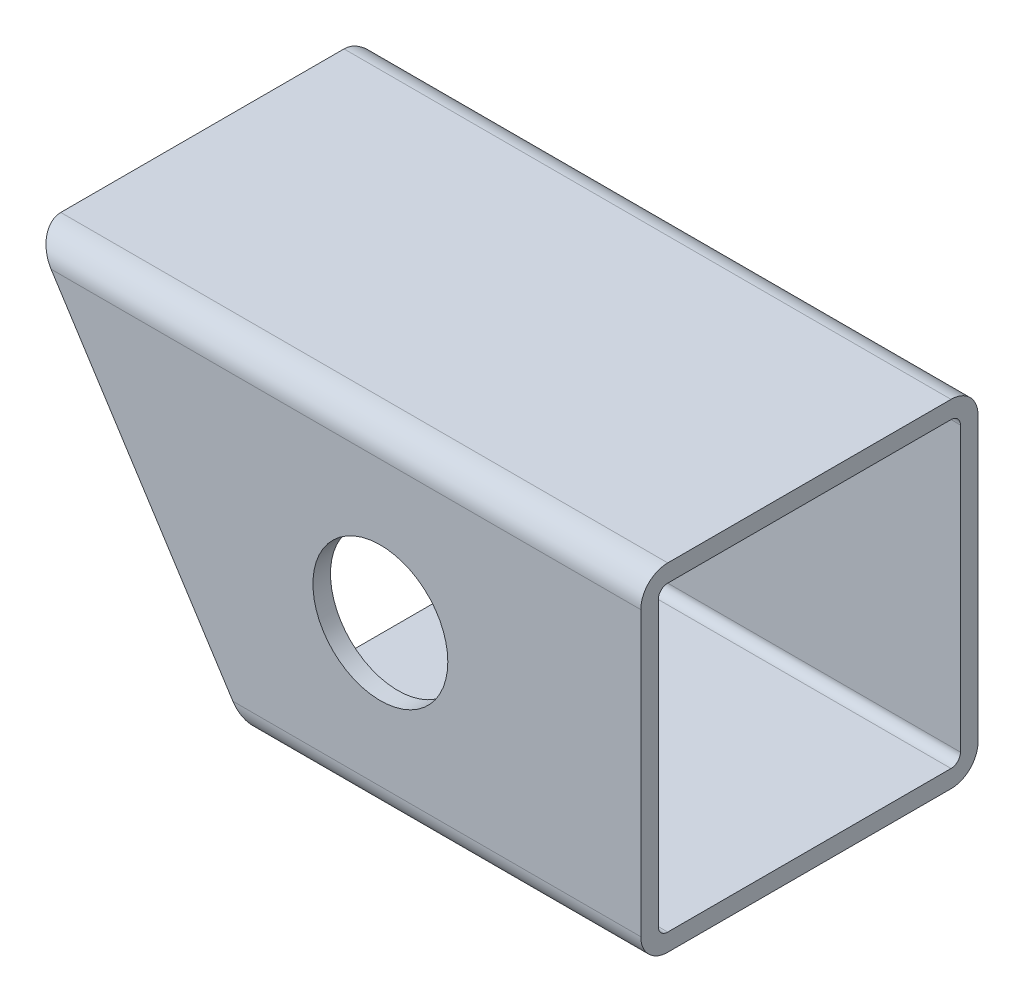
ISO-10303-21;
HEADER;
FILE_DESCRIPTION(('STEP AP214'),'2;1');
FILE_NAME('part.step','',(''),(''),'','','');
FILE_SCHEMA(('AUTOMOTIVE_DESIGN { 1 0 10303 214 1 1 1 1 }'));
ENDSEC;
DATA;
#1=APPLICATION_CONTEXT('core data for automotive mechanical design processes');
#2=APPLICATION_PROTOCOL_DEFINITION('international standard','automotive_design',2000,#1);
#3=PRODUCT_CONTEXT('',#1,'mechanical');
#4=PRODUCT('Part','Part','',(#3));
#5=PRODUCT_RELATED_PRODUCT_CATEGORY('part','',(#4));
#6=PRODUCT_DEFINITION_FORMATION('','',#4);
#7=PRODUCT_DEFINITION_CONTEXT('part definition',#1,'design');
#8=PRODUCT_DEFINITION('design','',#6,#7);
#9=PRODUCT_DEFINITION_SHAPE('','',#8);
#10=(LENGTH_UNIT() NAMED_UNIT(*) SI_UNIT(.MILLI.,.METRE.));
#11=(NAMED_UNIT(*) PLANE_ANGLE_UNIT() SI_UNIT($,.RADIAN.));
#12=(NAMED_UNIT(*) SI_UNIT($,.STERADIAN.) SOLID_ANGLE_UNIT());
#13=UNCERTAINTY_MEASURE_WITH_UNIT(LENGTH_MEASURE(1.E-05),#10,'distance_accuracy_value','');
#14=(GEOMETRIC_REPRESENTATION_CONTEXT(3) GLOBAL_UNCERTAINTY_ASSIGNED_CONTEXT((#13)) GLOBAL_UNIT_ASSIGNED_CONTEXT((#10,
#11,#12)) REPRESENTATION_CONTEXT('',''));
#15=CARTESIAN_POINT('',(0.,0.,0.));
#16=DIRECTION('',(0.,0.,1.));
#17=DIRECTION('',(1.,0.,0.));
#18=AXIS2_PLACEMENT_3D('',#15,#16,#17);
#19=CARTESIAN_POINT('',(57.15,2.54,29.21));
#20=DIRECTION('',(1.,0.,0.));
#21=DIRECTION('',(0.,0.,-1.));
#22=AXIS2_PLACEMENT_3D('',#19,#20,#21);
#23=PLANE('',#22);
#24=CARTESIAN_POINT('',(57.15,2.54,29.21));
#25=DIRECTION('',(1.,0.,0.));
#26=DIRECTION('',(0.,0.,-1.));
#27=AXIS2_PLACEMENT_3D('',#24,#25,#26);
#28=CIRCLE('',#27,2.54);
#29=CARTESIAN_POINT('',(57.15,2.54000000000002,31.75));
#30=VERTEX_POINT('',#29);
#31=CARTESIAN_POINT('',(57.15,0.,29.21));
#32=VERTEX_POINT('',#31);
#33=EDGE_CURVE('E243',#30,#32,#28,.T.);
#34=ORIENTED_EDGE('',*,*,#33,.T.);
#35=DIRECTION('',(0.,0.,-1.));
#36=VECTOR('',#35,1.);
#37=CARTESIAN_POINT('',(57.15,0.,29.21));
#38=LINE('',#37,#36);
#39=CARTESIAN_POINT('',(57.15,0.,2.54000000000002));
#40=VERTEX_POINT('',#39);
#41=EDGE_CURVE('E246',#32,#40,#38,.T.);
#42=ORIENTED_EDGE('',*,*,#41,.T.);
#43=CARTESIAN_POINT('',(57.15,2.54,2.54));
#44=DIRECTION('',(1.,0.,0.));
#45=DIRECTION('',(0.,0.,1.));
#46=AXIS2_PLACEMENT_3D('',#43,#44,#45);
#47=CIRCLE('',#46,2.54);
#48=CARTESIAN_POINT('',(57.15,2.54000000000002,0.));
#49=VERTEX_POINT('',#48);
#50=EDGE_CURVE('E248',#40,#49,#47,.T.);
#51=ORIENTED_EDGE('',*,*,#50,.T.);
#52=DIRECTION('',(0.,1.,0.));
#53=VECTOR('',#52,1.);
#54=CARTESIAN_POINT('',(57.15,2.54000000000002,0.));
#55=LINE('',#54,#53);
#56=CARTESIAN_POINT('',(57.15,29.21,0.));
#57=VERTEX_POINT('',#56);
#58=EDGE_CURVE('E250',#49,#57,#55,.T.);
#59=ORIENTED_EDGE('',*,*,#58,.T.);
#60=CARTESIAN_POINT('',(57.15,29.21,2.54));
#61=DIRECTION('',(1.,0.,0.));
#62=DIRECTION('',(0.,0.,-1.));
#63=AXIS2_PLACEMENT_3D('',#60,#61,#62);
#64=CIRCLE('',#63,2.54);
#65=CARTESIAN_POINT('',(57.15,31.75,2.54000000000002));
#66=VERTEX_POINT('',#65);
#67=EDGE_CURVE('E174',#57,#66,#64,.T.);
#68=ORIENTED_EDGE('',*,*,#67,.T.);
#69=DIRECTION('',(0.,0.,1.));
#70=VECTOR('',#69,1.);
#71=CARTESIAN_POINT('',(57.15,31.75,2.54000000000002));
#72=LINE('',#71,#70);
#73=CARTESIAN_POINT('',(57.15,31.75,29.21));
#74=VERTEX_POINT('',#73);
#75=EDGE_CURVE('E253',#66,#74,#72,.T.);
#76=ORIENTED_EDGE('',*,*,#75,.T.);
#77=CARTESIAN_POINT('',(57.15,29.21,29.21));
#78=DIRECTION('',(1.,0.,0.));
#79=DIRECTION('',(0.,0.,1.));
#80=AXIS2_PLACEMENT_3D('',#77,#78,#79);
#81=CIRCLE('',#80,2.54);
#82=CARTESIAN_POINT('',(57.15,29.21,31.75));
#83=VERTEX_POINT('',#82);
#84=EDGE_CURVE('E255',#74,#83,#81,.T.);
#85=ORIENTED_EDGE('',*,*,#84,.T.);
#86=DIRECTION('',(0.,-1.,0.));
#87=VECTOR('',#86,1.);
#88=CARTESIAN_POINT('',(57.15,29.21,31.75));
#89=LINE('',#88,#87);
#90=EDGE_CURVE('E257',#83,#30,#89,.T.);
#91=ORIENTED_EDGE('',*,*,#90,.T.);
#92=EDGE_LOOP('',(#34,#42,#51,#59,#68,#76,#85,#91));
#93=FACE_BOUND('',#92,.T.);
#94=DIRECTION('',(0.,1.,0.));
#95=VECTOR('',#94,1.);
#96=CARTESIAN_POINT('',(57.15,2.54000000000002,1.651));
#97=LINE('',#96,#95);
#98=CARTESIAN_POINT('',(57.15,2.54000000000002,1.651));
#99=VERTEX_POINT('',#98);
#100=CARTESIAN_POINT('',(57.15,29.21,1.651));
#101=VERTEX_POINT('',#100);
#102=EDGE_CURVE('E204',#99,#101,#97,.T.);
#103=ORIENTED_EDGE('',*,*,#102,.F.);
#104=CARTESIAN_POINT('',(57.15,2.54,2.54));
#105=DIRECTION('',(1.,0.,0.));
#106=DIRECTION('',(0.,0.,1.));
#107=AXIS2_PLACEMENT_3D('',#104,#105,#106);
#108=CIRCLE('',#107,0.889);
#109=CARTESIAN_POINT('',(57.15,1.651,2.54000000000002));
#110=VERTEX_POINT('',#109);
#111=EDGE_CURVE('E202',#110,#99,#108,.T.);
#112=ORIENTED_EDGE('',*,*,#111,.F.);
#113=DIRECTION('',(0.,0.,-1.));
#114=VECTOR('',#113,1.);
#115=CARTESIAN_POINT('',(57.15,1.651,29.21));
#116=LINE('',#115,#114);
#117=CARTESIAN_POINT('',(57.15,1.651,29.21));
#118=VERTEX_POINT('',#117);
#119=EDGE_CURVE('E217',#118,#110,#116,.T.);
#120=ORIENTED_EDGE('',*,*,#119,.F.);
#121=CARTESIAN_POINT('',(57.15,2.54,29.21));
#122=DIRECTION('',(1.,0.,0.));
#123=DIRECTION('',(0.,0.,-1.));
#124=AXIS2_PLACEMENT_3D('',#121,#122,#123);
#125=CIRCLE('',#124,0.889000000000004);
#126=CARTESIAN_POINT('',(57.15,2.54000000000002,30.099));
#127=VERTEX_POINT('',#126);
#128=EDGE_CURVE('E214',#127,#118,#125,.T.);
#129=ORIENTED_EDGE('',*,*,#128,.F.);
#130=DIRECTION('',(0.,-1.,0.));
#131=VECTOR('',#130,1.);
#132=CARTESIAN_POINT('',(57.15,29.21,30.099));
#133=LINE('',#132,#131);
#134=CARTESIAN_POINT('',(57.15,29.21,30.099));
#135=VERTEX_POINT('',#134);
#136=EDGE_CURVE('E212',#135,#127,#133,.T.);
#137=ORIENTED_EDGE('',*,*,#136,.F.);
#138=CARTESIAN_POINT('',(57.15,29.21,29.21));
#139=DIRECTION('',(1.,0.,0.));
#140=DIRECTION('',(0.,0.,1.));
#141=AXIS2_PLACEMENT_3D('',#138,#139,#140);
#142=CIRCLE('',#141,0.889000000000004);
#143=CARTESIAN_POINT('',(57.15,30.099,29.21));
#144=VERTEX_POINT('',#143);
#145=EDGE_CURVE('E210',#144,#135,#142,.T.);
#146=ORIENTED_EDGE('',*,*,#145,.F.);
#147=DIRECTION('',(0.,0.,1.));
#148=VECTOR('',#147,1.);
#149=CARTESIAN_POINT('',(57.15,30.099,2.54000000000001));
#150=LINE('',#149,#148);
#151=CARTESIAN_POINT('',(57.15,30.099,2.54000000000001));
#152=VERTEX_POINT('',#151);
#153=EDGE_CURVE('E208',#152,#144,#150,.T.);
#154=ORIENTED_EDGE('',*,*,#153,.F.);
#155=CARTESIAN_POINT('',(57.15,29.21,2.54));
#156=DIRECTION('',(1.,0.,0.));
#157=DIRECTION('',(0.,0.,-1.));
#158=AXIS2_PLACEMENT_3D('',#155,#156,#157);
#159=CIRCLE('',#158,0.889);
#160=EDGE_CURVE('E206',#101,#152,#159,.T.);
#161=ORIENTED_EDGE('',*,*,#160,.F.);
#162=EDGE_LOOP('',(#103,#112,#120,#129,#137,#146,#154,#161));
#163=FACE_BOUND('',#162,.T.);
#164=ADVANCED_FACE('F39',(#93,#163),#23,.T.);
#165=CARTESIAN_POINT('',(57.15,2.54,29.21));
#166=DIRECTION('',(-1.,0.,0.));
#167=DIRECTION('',(0.,0.,1.));
#168=AXIS2_PLACEMENT_3D('',#165,#166,#167);
#169=CYLINDRICAL_SURFACE('',#168,2.54);
#170=DIRECTION('',(-1.,0.,0.));
#171=VECTOR('',#170,1.);
#172=CARTESIAN_POINT('',(57.15,2.54000000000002,31.75));
#173=LINE('',#172,#171);
#174=CARTESIAN_POINT('',(18.746716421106,2.54000000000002,31.75));
#175=VERTEX_POINT('',#174);
#176=EDGE_CURVE('E259',#30,#175,#173,.T.);
#177=ORIENTED_EDGE('',*,*,#176,.T.);
#178=CARTESIAN_POINT('',(18.746716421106,2.54,29.21));
#179=DIRECTION('',(0.841586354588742,0.540122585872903,0.));
#180=DIRECTION('',(-0.540122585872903,0.841586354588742,0.));
#181=AXIS2_PLACEMENT_3D('',#178,#179,#180);
#182=ELLIPSE('',#181,3.01810977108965,2.54);
#183=CARTESIAN_POINT('',(20.3768656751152,0.,29.21));
#184=VERTEX_POINT('',#183);
#185=EDGE_CURVE('E54',#175,#184,#182,.T.);
#186=ORIENTED_EDGE('',*,*,#185,.T.);
#187=DIRECTION('',(-1.,0.,0.));
#188=VECTOR('',#187,1.);
#189=CARTESIAN_POINT('',(57.15,0.,29.21));
#190=LINE('',#189,#188);
#191=EDGE_CURVE('E47',#32,#184,#190,.T.);
#192=ORIENTED_EDGE('',*,*,#191,.F.);
#193=ORIENTED_EDGE('',*,*,#33,.F.);
#194=EDGE_LOOP('',(#177,#186,#192,#193));
#195=FACE_BOUND('',#194,.T.);
#196=ADVANCED_FACE('F41',(#195),#169,.T.);
#197=CARTESIAN_POINT('',(57.15,0.,29.21));
#198=DIRECTION('',(0.,1.,0.));
#199=DIRECTION('',(0.,0.,1.));
#200=AXIS2_PLACEMENT_3D('',#197,#198,#199);
#201=PLANE('',#200);
#202=ORIENTED_EDGE('',*,*,#191,.T.);
#203=DIRECTION('',(0.,0.,-1.));
#204=VECTOR('',#203,1.);
#205=CARTESIAN_POINT('',(20.3768656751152,0.,29.21));
#206=LINE('',#205,#204);
#207=CARTESIAN_POINT('',(20.3768656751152,0.,2.54000000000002));
#208=VERTEX_POINT('',#207);
#209=EDGE_CURVE('E283',#184,#208,#206,.T.);
#210=ORIENTED_EDGE('',*,*,#209,.T.);
#211=DIRECTION('',(-1.,0.,0.));
#212=VECTOR('',#211,1.);
#213=CARTESIAN_POINT('',(57.15,0.,2.54000000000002));
#214=LINE('',#213,#212);
#215=EDGE_CURVE('E177',#40,#208,#214,.T.);
#216=ORIENTED_EDGE('',*,*,#215,.F.);
#217=ORIENTED_EDGE('',*,*,#41,.F.);
#218=EDGE_LOOP('',(#202,#210,#216,#217));
#219=FACE_BOUND('',#218,.T.);
#220=ADVANCED_FACE('F355',(#219),#201,.F.);
#221=CARTESIAN_POINT('',(57.15,2.54,2.54));
#222=DIRECTION('',(-1.,0.,0.));
#223=DIRECTION('',(0.,0.,1.));
#224=AXIS2_PLACEMENT_3D('',#221,#222,#223);
#225=CYLINDRICAL_SURFACE('',#224,2.54);
#226=ORIENTED_EDGE('',*,*,#215,.T.);
#227=CARTESIAN_POINT('',(18.746716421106,2.54,2.54));
#228=DIRECTION('',(0.841586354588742,0.540122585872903,0.));
#229=DIRECTION('',(-0.540122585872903,0.841586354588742,0.));
#230=AXIS2_PLACEMENT_3D('',#227,#228,#229);
#231=ELLIPSE('',#230,3.01810977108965,2.54);
#232=CARTESIAN_POINT('',(18.746716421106,2.54000000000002,0.));
#233=VERTEX_POINT('',#232);
#234=EDGE_CURVE('E161',#208,#233,#231,.T.);
#235=ORIENTED_EDGE('',*,*,#234,.T.);
#236=DIRECTION('',(-1.,0.,0.));
#237=VECTOR('',#236,1.);
#238=CARTESIAN_POINT('',(57.15,2.54000000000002,0.));
#239=LINE('',#238,#237);
#240=EDGE_CURVE('E171',#49,#233,#239,.T.);
#241=ORIENTED_EDGE('',*,*,#240,.F.);
#242=ORIENTED_EDGE('',*,*,#50,.F.);
#243=EDGE_LOOP('',(#226,#235,#241,#242));
#244=FACE_BOUND('',#243,.T.);
#245=ADVANCED_FACE('F281',(#244),#225,.T.);
#246=CARTESIAN_POINT('',(57.15,2.54000000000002,0.));
#247=DIRECTION('',(0.,0.,1.));
#248=DIRECTION('',(1.,0.,0.));
#249=AXIS2_PLACEMENT_3D('',#246,#247,#248);
#250=PLANE('',#249);
#251=CARTESIAN_POINT('',(32.6335611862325,15.8750000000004,0.));
#252=DIRECTION('',(0.,0.,1.));
#253=DIRECTION('',(1.,0.,0.));
#254=AXIS2_PLACEMENT_3D('',#251,#252,#253);
#255=CIRCLE('',#254,6.35);
#256=CARTESIAN_POINT('',(38.9835611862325,15.8750000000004,0.));
#257=VERTEX_POINT('',#256);
#258=EDGE_CURVE('E192',#257,#257,#255,.T.);
#259=ORIENTED_EDGE('',*,*,#258,.T.);
#260=EDGE_LOOP('',(#259));
#261=FACE_BOUND('',#260,.T.);
#262=ORIENTED_EDGE('',*,*,#240,.T.);
#263=DIRECTION('',(0.540122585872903,-0.841586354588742,0.));
#264=VECTOR('',#263,1.);
#265=CARTESIAN_POINT('',(20.3768656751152,0.,0.));
#266=LINE('',#265,#264);
#267=CARTESIAN_POINT('',(1.63014925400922,29.21,0.));
#268=VERTEX_POINT('',#267);
#269=EDGE_CURVE('E152',#268,#233,#266,.T.);
#270=ORIENTED_EDGE('',*,*,#269,.F.);
#271=DIRECTION('',(-1.,0.,0.));
#272=VECTOR('',#271,1.);
#273=CARTESIAN_POINT('',(57.15,29.21,0.));
#274=LINE('',#273,#272);
#275=EDGE_CURVE('E168',#57,#268,#274,.T.);
#276=ORIENTED_EDGE('',*,*,#275,.F.);
#277=ORIENTED_EDGE('',*,*,#58,.F.);
#278=EDGE_LOOP('',(#262,#270,#276,#277));
#279=FACE_BOUND('',#278,.T.);
#280=ADVANCED_FACE('F166',(#261,#279),#250,.F.);
#281=CARTESIAN_POINT('',(57.15,29.21,2.54));
#282=DIRECTION('',(-1.,0.,0.));
#283=DIRECTION('',(0.,0.,1.));
#284=AXIS2_PLACEMENT_3D('',#281,#282,#283);
#285=CYLINDRICAL_SURFACE('',#284,2.54);
#286=ORIENTED_EDGE('',*,*,#275,.T.);
#287=CARTESIAN_POINT('',(1.63014925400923,29.21,2.54));
#288=DIRECTION('',(0.841586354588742,0.540122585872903,0.));
#289=DIRECTION('',(-0.540122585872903,0.841586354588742,0.));
#290=AXIS2_PLACEMENT_3D('',#287,#288,#289);
#291=ELLIPSE('',#290,3.01810977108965,2.54);
#292=CARTESIAN_POINT('',(0.,31.75,2.54000000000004));
#293=VERTEX_POINT('',#292);
#294=EDGE_CURVE('E149',#268,#293,#291,.T.);
#295=ORIENTED_EDGE('',*,*,#294,.T.);
#296=DIRECTION('',(-1.,0.,0.));
#297=VECTOR('',#296,1.);
#298=CARTESIAN_POINT('',(57.15,31.75,2.54000000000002));
#299=LINE('',#298,#297);
#300=EDGE_CURVE('E175',#66,#293,#299,.T.);
#301=ORIENTED_EDGE('',*,*,#300,.F.);
#302=ORIENTED_EDGE('',*,*,#67,.F.);
#303=EDGE_LOOP('',(#286,#295,#301,#302));
#304=FACE_BOUND('',#303,.T.);
#305=ADVANCED_FACE('F173',(#304),#285,.T.);
#306=CARTESIAN_POINT('',(57.15,31.75,2.54000000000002));
#307=DIRECTION('',(0.,-1.,0.));
#308=DIRECTION('',(0.,0.,-1.));
#309=AXIS2_PLACEMENT_3D('',#306,#307,#308);
#310=PLANE('',#309);
#311=DIRECTION('',(0.,0.,1.));
#312=VECTOR('',#311,1.);
#313=CARTESIAN_POINT('',(0.,31.75,2.54000000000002));
#314=LINE('',#313,#312);
#315=CARTESIAN_POINT('',(0.,31.75,29.21));
#316=VERTEX_POINT('',#315);
#317=EDGE_CURVE('E155',#293,#316,#314,.T.);
#318=ORIENTED_EDGE('',*,*,#317,.T.);
#319=DIRECTION('',(-1.,0.,0.));
#320=VECTOR('',#319,1.);
#321=CARTESIAN_POINT('',(57.15,31.75,29.21));
#322=LINE('',#321,#320);
#323=EDGE_CURVE('E179',#74,#316,#322,.T.);
#324=ORIENTED_EDGE('',*,*,#323,.F.);
#325=ORIENTED_EDGE('',*,*,#75,.F.);
#326=ORIENTED_EDGE('',*,*,#300,.T.);
#327=EDGE_LOOP('',(#318,#324,#325,#326));
#328=FACE_BOUND('',#327,.T.);
#329=ADVANCED_FACE('F275',(#328),#310,.F.);
#330=CARTESIAN_POINT('',(57.15,29.21,29.21));
#331=DIRECTION('',(-1.,0.,0.));
#332=DIRECTION('',(0.,0.,1.));
#333=AXIS2_PLACEMENT_3D('',#330,#331,#332);
#334=CYLINDRICAL_SURFACE('',#333,2.54);
#335=ORIENTED_EDGE('',*,*,#323,.T.);
#336=CARTESIAN_POINT('',(1.63014925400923,29.21,29.21));
#337=DIRECTION('',(0.841586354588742,0.540122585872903,0.));
#338=DIRECTION('',(-0.540122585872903,0.841586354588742,0.));
#339=AXIS2_PLACEMENT_3D('',#336,#337,#338);
#340=ELLIPSE('',#339,3.01810977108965,2.54);
#341=CARTESIAN_POINT('',(1.63014925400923,29.21,31.75));
#342=VERTEX_POINT('',#341);
#343=EDGE_CURVE('E272',#316,#342,#340,.T.);
#344=ORIENTED_EDGE('',*,*,#343,.T.);
#345=DIRECTION('',(-1.,0.,0.));
#346=VECTOR('',#345,1.);
#347=CARTESIAN_POINT('',(57.15,29.21,31.75));
#348=LINE('',#347,#346);
#349=EDGE_CURVE('E263',#83,#342,#348,.T.);
#350=ORIENTED_EDGE('',*,*,#349,.F.);
#351=ORIENTED_EDGE('',*,*,#84,.F.);
#352=EDGE_LOOP('',(#335,#344,#350,#351));
#353=FACE_BOUND('',#352,.T.);
#354=ADVANCED_FACE('F270',(#353),#334,.T.);
#355=CARTESIAN_POINT('',(57.15,29.21,31.75));
#356=DIRECTION('',(0.,0.,-1.));
#357=DIRECTION('',(0.,1.,0.));
#358=AXIS2_PLACEMENT_3D('',#355,#356,#357);
#359=PLANE('',#358);
#360=CARTESIAN_POINT('',(32.6335611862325,15.8750000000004,31.75));
#361=DIRECTION('',(0.,0.,1.));
#362=DIRECTION('',(1.,0.,0.));
#363=AXIS2_PLACEMENT_3D('',#360,#361,#362);
#364=CIRCLE('',#363,6.35);
#365=CARTESIAN_POINT('',(38.9835611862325,15.8750000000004,31.75));
#366=VERTEX_POINT('',#365);
#367=EDGE_CURVE('E160',#366,#366,#364,.T.);
#368=ORIENTED_EDGE('',*,*,#367,.F.);
#369=EDGE_LOOP('',(#368));
#370=FACE_BOUND('',#369,.T.);
#371=ORIENTED_EDGE('',*,*,#349,.T.);
#372=DIRECTION('',(0.540122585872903,-0.841586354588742,0.));
#373=VECTOR('',#372,1.);
#374=CARTESIAN_POINT('',(17.8270889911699,3.97290785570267,31.75));
#375=LINE('',#374,#373);
#376=EDGE_CURVE('E288',#342,#175,#375,.T.);
#377=ORIENTED_EDGE('',*,*,#376,.T.);
#378=ORIENTED_EDGE('',*,*,#176,.F.);
#379=ORIENTED_EDGE('',*,*,#90,.F.);
#380=EDGE_LOOP('',(#371,#377,#378,#379));
#381=FACE_BOUND('',#380,.T.);
#382=ADVANCED_FACE('F360',(#370,#381),#359,.F.);
#383=CARTESIAN_POINT('',(57.15,2.54,2.54));
#384=DIRECTION('',(-1.,0.,0.));
#385=DIRECTION('',(0.,0.,1.));
#386=AXIS2_PLACEMENT_3D('',#383,#384,#385);
#387=CYLINDRICAL_SURFACE('',#386,0.889);
#388=CARTESIAN_POINT('',(18.746716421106,2.54,2.54));
#389=DIRECTION('',(0.841586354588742,0.540122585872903,0.));
#390=DIRECTION('',(-0.540122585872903,0.841586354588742,0.));
#391=AXIS2_PLACEMENT_3D('',#388,#389,#390);
#392=ELLIPSE('',#391,1.05633841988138,0.889);
#393=CARTESIAN_POINT('',(19.3172686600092,1.651,2.54000000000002));
#394=VERTEX_POINT('',#393);
#395=CARTESIAN_POINT('',(18.746716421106,2.54000000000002,1.651));
#396=VERTEX_POINT('',#395);
#397=EDGE_CURVE('E290',#394,#396,#392,.T.);
#398=ORIENTED_EDGE('',*,*,#397,.F.);
#399=DIRECTION('',(-1.,0.,0.));
#400=VECTOR('',#399,1.);
#401=CARTESIAN_POINT('',(57.15,1.651,2.54000000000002));
#402=LINE('',#401,#400);
#403=EDGE_CURVE('E219',#110,#394,#402,.T.);
#404=ORIENTED_EDGE('',*,*,#403,.F.);
#405=ORIENTED_EDGE('',*,*,#111,.T.);
#406=DIRECTION('',(-1.,0.,0.));
#407=VECTOR('',#406,1.);
#408=CARTESIAN_POINT('',(57.15,2.54000000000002,1.651));
#409=LINE('',#408,#407);
#410=EDGE_CURVE('E240',#99,#396,#409,.T.);
#411=ORIENTED_EDGE('',*,*,#410,.T.);
#412=EDGE_LOOP('',(#398,#404,#405,#411));
#413=FACE_BOUND('',#412,.T.);
#414=ADVANCED_FACE('F323',(#413),#387,.F.);
#415=CARTESIAN_POINT('',(57.15,2.54000000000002,1.651));
#416=DIRECTION('',(0.,0.,1.));
#417=DIRECTION('',(1.,0.,0.));
#418=AXIS2_PLACEMENT_3D('',#415,#416,#417);
#419=PLANE('',#418);
#420=DIRECTION('',(-0.540122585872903,0.841586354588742,0.));
#421=VECTOR('',#420,1.);
#422=CARTESIAN_POINT('',(29.9501988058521,-14.9165888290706,1.651));
#423=LINE('',#422,#421);
#424=CARTESIAN_POINT('',(1.63014925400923,29.21,1.651));
#425=VERTEX_POINT('',#424);
#426=EDGE_CURVE('E292',#396,#425,#423,.T.);
#427=ORIENTED_EDGE('',*,*,#426,.F.);
#428=ORIENTED_EDGE('',*,*,#410,.F.);
#429=ORIENTED_EDGE('',*,*,#102,.T.);
#430=DIRECTION('',(-1.,0.,0.));
#431=VECTOR('',#430,1.);
#432=CARTESIAN_POINT('',(57.15,29.21,1.651));
#433=LINE('',#432,#431);
#434=EDGE_CURVE('E237',#101,#425,#433,.T.);
#435=ORIENTED_EDGE('',*,*,#434,.T.);
#436=EDGE_LOOP('',(#427,#428,#429,#435));
#437=FACE_BOUND('',#436,.T.);
#438=CARTESIAN_POINT('',(32.6335611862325,15.8750000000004,1.651));
#439=DIRECTION('',(0.,0.,1.));
#440=DIRECTION('',(1.,0.,0.));
#441=AXIS2_PLACEMENT_3D('',#438,#439,#440);
#442=CIRCLE('',#441,6.35);
#443=CARTESIAN_POINT('',(38.9835611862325,15.8750000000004,1.651));
#444=VERTEX_POINT('',#443);
#445=EDGE_CURVE('E188',#444,#444,#442,.T.);
#446=ORIENTED_EDGE('',*,*,#445,.F.);
#447=EDGE_LOOP('',(#446));
#448=FACE_BOUND('',#447,.T.);
#449=ADVANCED_FACE('F328',(#437,#448),#419,.T.);
#450=CARTESIAN_POINT('',(57.15,29.21,2.54));
#451=DIRECTION('',(-1.,0.,0.));
#452=DIRECTION('',(0.,0.,1.));
#453=AXIS2_PLACEMENT_3D('',#450,#451,#452);
#454=CYLINDRICAL_SURFACE('',#453,0.889);
#455=CARTESIAN_POINT('',(1.63014925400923,29.21,2.54));
#456=DIRECTION('',(0.841586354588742,0.540122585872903,0.));
#457=DIRECTION('',(-0.540122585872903,0.841586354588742,0.));
#458=AXIS2_PLACEMENT_3D('',#455,#456,#457);
#459=ELLIPSE('',#458,1.05633841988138,0.889);
#460=CARTESIAN_POINT('',(1.059597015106,30.099,2.54000000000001));
#461=VERTEX_POINT('',#460);
#462=EDGE_CURVE('E294',#425,#461,#459,.T.);
#463=ORIENTED_EDGE('',*,*,#462,.F.);
#464=ORIENTED_EDGE('',*,*,#434,.F.);
#465=ORIENTED_EDGE('',*,*,#160,.T.);
#466=DIRECTION('',(-1.,0.,0.));
#467=VECTOR('',#466,1.);
#468=CARTESIAN_POINT('',(57.15,30.099,2.54000000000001));
#469=LINE('',#468,#467);
#470=EDGE_CURVE('E234',#152,#461,#469,.T.);
#471=ORIENTED_EDGE('',*,*,#470,.T.);
#472=EDGE_LOOP('',(#463,#464,#465,#471));
#473=FACE_BOUND('',#472,.T.);
#474=ADVANCED_FACE('F333',(#473),#454,.F.);
#475=CARTESIAN_POINT('',(57.15,30.099,2.54000000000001));
#476=DIRECTION('',(0.,-1.,0.));
#477=DIRECTION('',(0.,0.,-1.));
#478=AXIS2_PLACEMENT_3D('',#475,#476,#477);
#479=PLANE('',#478);
#480=DIRECTION('',(0.,0.,1.));
#481=VECTOR('',#480,1.);
#482=CARTESIAN_POINT('',(1.059597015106,30.099,2.54000000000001));
#483=LINE('',#482,#481);
#484=CARTESIAN_POINT('',(1.059597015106,30.099,29.21));
#485=VERTEX_POINT('',#484);
#486=EDGE_CURVE('E296',#461,#485,#483,.T.);
#487=ORIENTED_EDGE('',*,*,#486,.F.);
#488=ORIENTED_EDGE('',*,*,#470,.F.);
#489=ORIENTED_EDGE('',*,*,#153,.T.);
#490=DIRECTION('',(-1.,0.,0.));
#491=VECTOR('',#490,1.);
#492=CARTESIAN_POINT('',(57.15,30.099,29.21));
#493=LINE('',#492,#491);
#494=EDGE_CURVE('E231',#144,#485,#493,.T.);
#495=ORIENTED_EDGE('',*,*,#494,.T.);
#496=EDGE_LOOP('',(#487,#488,#489,#495));
#497=FACE_BOUND('',#496,.T.);
#498=ADVANCED_FACE('F338',(#497),#479,.T.);
#499=CARTESIAN_POINT('',(57.15,29.21,29.21));
#500=DIRECTION('',(-1.,0.,0.));
#501=DIRECTION('',(0.,0.,1.));
#502=AXIS2_PLACEMENT_3D('',#499,#500,#501);
#503=CYLINDRICAL_SURFACE('',#502,0.889000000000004);
#504=CARTESIAN_POINT('',(1.63014925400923,29.21,29.21));
#505=DIRECTION('',(0.841586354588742,0.540122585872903,0.));
#506=DIRECTION('',(-0.540122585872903,0.841586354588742,0.));
#507=AXIS2_PLACEMENT_3D('',#504,#505,#506);
#508=ELLIPSE('',#507,1.05633841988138,0.889000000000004);
#509=CARTESIAN_POINT('',(1.63014925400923,29.21,30.099));
#510=VERTEX_POINT('',#509);
#511=EDGE_CURVE('E298',#485,#510,#508,.T.);
#512=ORIENTED_EDGE('',*,*,#511,.F.);
#513=ORIENTED_EDGE('',*,*,#494,.F.);
#514=ORIENTED_EDGE('',*,*,#145,.T.);
#515=DIRECTION('',(-1.,0.,0.));
#516=VECTOR('',#515,1.);
#517=CARTESIAN_POINT('',(57.15,29.21,30.099));
#518=LINE('',#517,#516);
#519=EDGE_CURVE('E228',#135,#510,#518,.T.);
#520=ORIENTED_EDGE('',*,*,#519,.T.);
#521=EDGE_LOOP('',(#512,#513,#514,#520));
#522=FACE_BOUND('',#521,.T.);
#523=ADVANCED_FACE('F340',(#522),#503,.F.);
#524=CARTESIAN_POINT('',(57.15,29.21,30.099));
#525=DIRECTION('',(0.,0.,-1.));
#526=DIRECTION('',(-1.,0.,0.));
#527=AXIS2_PLACEMENT_3D('',#524,#525,#526);
#528=PLANE('',#527);
#529=DIRECTION('',(0.540122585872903,-0.841586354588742,0.));
#530=VECTOR('',#529,1.);
#531=CARTESIAN_POINT('',(17.8270889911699,3.97290785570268,30.099));
#532=LINE('',#531,#530);
#533=CARTESIAN_POINT('',(18.746716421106,2.54000000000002,30.099));
#534=VERTEX_POINT('',#533);
#535=EDGE_CURVE('E300',#510,#534,#532,.T.);
#536=ORIENTED_EDGE('',*,*,#535,.F.);
#537=ORIENTED_EDGE('',*,*,#519,.F.);
#538=ORIENTED_EDGE('',*,*,#136,.T.);
#539=DIRECTION('',(-1.,0.,0.));
#540=VECTOR('',#539,1.);
#541=CARTESIAN_POINT('',(57.15,2.54000000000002,30.099));
#542=LINE('',#541,#540);
#543=EDGE_CURVE('E225',#127,#534,#542,.T.);
#544=ORIENTED_EDGE('',*,*,#543,.T.);
#545=EDGE_LOOP('',(#536,#537,#538,#544));
#546=FACE_BOUND('',#545,.T.);
#547=CARTESIAN_POINT('',(32.6335611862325,15.8750000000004,30.099));
#548=DIRECTION('',(0.,0.,-1.));
#549=DIRECTION('',(-1.,0.,0.));
#550=AXIS2_PLACEMENT_3D('',#547,#548,#549);
#551=CIRCLE('',#550,6.35);
#552=CARTESIAN_POINT('',(38.9835611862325,15.8750000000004,30.099));
#553=VERTEX_POINT('',#552);
#554=EDGE_CURVE('E186',#553,#553,#551,.T.);
#555=ORIENTED_EDGE('',*,*,#554,.F.);
#556=EDGE_LOOP('',(#555));
#557=FACE_BOUND('',#556,.T.);
#558=ADVANCED_FACE('F310',(#546,#557),#528,.T.);
#559=CARTESIAN_POINT('',(57.15,2.54,29.21));
#560=DIRECTION('',(-1.,0.,0.));
#561=DIRECTION('',(0.,0.,1.));
#562=AXIS2_PLACEMENT_3D('',#559,#560,#561);
#563=CYLINDRICAL_SURFACE('',#562,0.889000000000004);
#564=CARTESIAN_POINT('',(18.746716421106,2.54,29.21));
#565=DIRECTION('',(0.841586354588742,0.540122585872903,0.));
#566=DIRECTION('',(-0.540122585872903,0.841586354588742,0.));
#567=AXIS2_PLACEMENT_3D('',#564,#565,#566);
#568=ELLIPSE('',#567,1.05633841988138,0.889000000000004);
#569=CARTESIAN_POINT('',(19.3172686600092,1.651,29.21));
#570=VERTEX_POINT('',#569);
#571=EDGE_CURVE('E61',#534,#570,#568,.T.);
#572=ORIENTED_EDGE('',*,*,#571,.F.);
#573=ORIENTED_EDGE('',*,*,#543,.F.);
#574=ORIENTED_EDGE('',*,*,#128,.T.);
#575=DIRECTION('',(-1.,0.,0.));
#576=VECTOR('',#575,1.);
#577=CARTESIAN_POINT('',(57.15,1.651,29.21));
#578=LINE('',#577,#576);
#579=EDGE_CURVE('E222',#118,#570,#578,.T.);
#580=ORIENTED_EDGE('',*,*,#579,.T.);
#581=EDGE_LOOP('',(#572,#573,#574,#580));
#582=FACE_BOUND('',#581,.T.);
#583=ADVANCED_FACE('F308',(#582),#563,.F.);
#584=CARTESIAN_POINT('',(57.15,1.651,29.21));
#585=DIRECTION('',(0.,1.,0.));
#586=DIRECTION('',(0.,0.,1.));
#587=AXIS2_PLACEMENT_3D('',#584,#585,#586);
#588=PLANE('',#587);
#589=DIRECTION('',(0.,0.,-1.));
#590=VECTOR('',#589,1.);
#591=CARTESIAN_POINT('',(19.3172686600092,1.651,29.21));
#592=LINE('',#591,#590);
#593=EDGE_CURVE('E11',#570,#394,#592,.T.);
#594=ORIENTED_EDGE('',*,*,#593,.F.);
#595=ORIENTED_EDGE('',*,*,#579,.F.);
#596=ORIENTED_EDGE('',*,*,#119,.T.);
#597=ORIENTED_EDGE('',*,*,#403,.T.);
#598=EDGE_LOOP('',(#594,#595,#596,#597));
#599=FACE_BOUND('',#598,.T.);
#600=ADVANCED_FACE('F320',(#599),#588,.T.);
#601=CARTESIAN_POINT('',(32.6335611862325,15.8750000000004,-6.35000000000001));
#602=DIRECTION('',(0.,0.,1.));
#603=DIRECTION('',(1.,0.,0.));
#604=AXIS2_PLACEMENT_3D('',#601,#602,#603);
#605=CYLINDRICAL_SURFACE('',#604,6.35);
#606=CARTESIAN_POINT('',(38.9835611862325,15.8750000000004,30.099));
#607=CARTESIAN_POINT('',(38.9835611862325,15.8750000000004,30.1161979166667));
#608=CARTESIAN_POINT('',(38.9835611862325,15.8750000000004,30.1333958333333));
#609=CARTESIAN_POINT('',(38.9835611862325,15.8750000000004,30.1677916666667));
#610=CARTESIAN_POINT('',(38.9835611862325,15.8750000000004,30.1849895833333));
#611=CARTESIAN_POINT('',(38.9835611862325,15.8750000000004,30.2193854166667));
#612=CARTESIAN_POINT('',(38.9835611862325,15.8750000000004,30.2365833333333));
#613=CARTESIAN_POINT('',(38.9835611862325,15.8750000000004,30.2709791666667));
#614=CARTESIAN_POINT('',(38.9835611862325,15.8750000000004,30.2881770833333));
#615=CARTESIAN_POINT('',(38.9835611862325,15.8750000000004,30.3225729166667));
#616=CARTESIAN_POINT('',(38.9835611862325,15.8750000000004,30.3397708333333));
#617=CARTESIAN_POINT('',(38.9835611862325,15.8750000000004,30.3741666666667));
#618=CARTESIAN_POINT('',(38.9835611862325,15.8750000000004,30.3913645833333));
#619=CARTESIAN_POINT('',(38.9835611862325,15.8750000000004,30.4257604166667));
#620=CARTESIAN_POINT('',(38.9835611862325,15.8750000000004,30.4429583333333));
#621=CARTESIAN_POINT('',(38.9835611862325,15.8750000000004,30.4773541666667));
#622=CARTESIAN_POINT('',(38.9835611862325,15.8750000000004,30.4945520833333));
#623=CARTESIAN_POINT('',(38.9835611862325,15.8750000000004,30.5289479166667));
#624=CARTESIAN_POINT('',(38.9835611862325,15.8750000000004,30.5461458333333));
#625=CARTESIAN_POINT('',(38.9835611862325,15.8750000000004,30.5805416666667));
#626=CARTESIAN_POINT('',(38.9835611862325,15.8750000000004,30.5977395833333));
#627=CARTESIAN_POINT('',(38.9835611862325,15.8750000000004,30.6321354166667));
#628=CARTESIAN_POINT('',(38.9835611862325,15.8750000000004,30.6493333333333));
#629=CARTESIAN_POINT('',(38.9835611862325,15.8750000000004,30.6837291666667));
#630=CARTESIAN_POINT('',(38.9835611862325,15.8750000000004,30.7009270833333));
#631=CARTESIAN_POINT('',(38.9835611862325,15.8750000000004,30.7353229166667));
#632=CARTESIAN_POINT('',(38.9835611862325,15.8750000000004,30.7525208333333));
#633=CARTESIAN_POINT('',(38.9835611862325,15.8750000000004,30.7869166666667));
#634=CARTESIAN_POINT('',(38.9835611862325,15.8750000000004,30.8041145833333));
#635=CARTESIAN_POINT('',(38.9835611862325,15.8750000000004,30.8385104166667));
#636=CARTESIAN_POINT('',(38.9835611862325,15.8750000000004,30.8557083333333));
#637=CARTESIAN_POINT('',(38.9835611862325,15.8750000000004,30.8901041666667));
#638=CARTESIAN_POINT('',(38.9835611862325,15.8750000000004,30.9073020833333));
#639=CARTESIAN_POINT('',(38.9835611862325,15.8750000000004,30.9416979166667));
#640=CARTESIAN_POINT('',(38.9835611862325,15.8750000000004,30.9588958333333));
#641=CARTESIAN_POINT('',(38.9835611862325,15.8750000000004,30.9932916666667));
#642=CARTESIAN_POINT('',(38.9835611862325,15.8750000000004,31.0104895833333));
#643=CARTESIAN_POINT('',(38.9835611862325,15.8750000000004,31.0448854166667));
#644=CARTESIAN_POINT('',(38.9835611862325,15.8750000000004,31.0620833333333));
#645=CARTESIAN_POINT('',(38.9835611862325,15.8750000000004,31.0964791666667));
#646=CARTESIAN_POINT('',(38.9835611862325,15.8750000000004,31.1136770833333));
#647=CARTESIAN_POINT('',(38.9835611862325,15.8750000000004,31.1480729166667));
#648=CARTESIAN_POINT('',(38.9835611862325,15.8750000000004,31.1652708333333));
#649=CARTESIAN_POINT('',(38.9835611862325,15.8750000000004,31.1996666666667));
#650=CARTESIAN_POINT('',(38.9835611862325,15.8750000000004,31.2168645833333));
#651=CARTESIAN_POINT('',(38.9835611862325,15.8750000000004,31.2512604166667));
#652=CARTESIAN_POINT('',(38.9835611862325,15.8750000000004,31.2684583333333));
#653=CARTESIAN_POINT('',(38.9835611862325,15.8750000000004,31.3028541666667));
#654=CARTESIAN_POINT('',(38.9835611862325,15.8750000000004,31.3200520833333));
#655=CARTESIAN_POINT('',(38.9835611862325,15.8750000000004,31.3544479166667));
#656=CARTESIAN_POINT('',(38.9835611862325,15.8750000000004,31.3716458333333));
#657=CARTESIAN_POINT('',(38.9835611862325,15.8750000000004,31.4060416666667));
#658=CARTESIAN_POINT('',(38.9835611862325,15.8750000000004,31.4232395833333));
#659=CARTESIAN_POINT('',(38.9835611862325,15.8750000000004,31.4576354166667));
#660=CARTESIAN_POINT('',(38.9835611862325,15.8750000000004,31.4748333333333));
#661=CARTESIAN_POINT('',(38.9835611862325,15.8750000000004,31.5092291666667));
#662=CARTESIAN_POINT('',(38.9835611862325,15.8750000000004,31.5264270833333));
#663=CARTESIAN_POINT('',(38.9835611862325,15.8750000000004,31.5608229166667));
#664=CARTESIAN_POINT('',(38.9835611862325,15.8750000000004,31.5780208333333));
#665=CARTESIAN_POINT('',(38.9835611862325,15.8750000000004,31.6124166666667));
#666=CARTESIAN_POINT('',(38.9835611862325,15.8750000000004,31.6296145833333));
#667=CARTESIAN_POINT('',(38.9835611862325,15.8750000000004,31.6640104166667));
#668=CARTESIAN_POINT('',(38.9835611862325,15.8750000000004,31.6812083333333));
#669=CARTESIAN_POINT('',(38.9835611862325,15.8750000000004,31.7156041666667));
#670=CARTESIAN_POINT('',(38.9835611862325,15.8750000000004,31.7328020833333));
#671=CARTESIAN_POINT('',(38.9835611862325,15.8750000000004,31.75));
#672=B_SPLINE_CURVE_WITH_KNOTS('',3,(#606,#607,#608,#609,#610,#611,#612,#613,#614,#615,#616,
#617,#618,#619,#620,#621,#622,#623,#624,#625,#626,#627,#628,#629,#630,#631,#632,#633,#634,#635,
#636,#637,#638,#639,#640,#641,#642,#643,#644,#645,#646,#647,#648,#649,#650,#651,#652,#653,#654,
#655,#656,#657,#658,#659,#660,#661,#662,#663,#664,#665,#666,#667,#668,#669,#670,#671),
.UNSPECIFIED.,.F.,.F.,(4,2,2,2,2,2,2,2,2,2,2,2,2,2,2,2,2,2,2,2,2,2,2,2,2,2,2,2,2,2,2,2,4),(0.,
0.0515937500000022,0.103187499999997,0.15478125,0.206374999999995,0.257968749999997,
0.309562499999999,0.361156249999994,0.412749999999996,0.464343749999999,0.515937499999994,
0.567531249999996,0.619124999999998,0.670718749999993,0.722312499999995,0.773906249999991,
0.825499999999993,0.877093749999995,0.92868749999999,0.980281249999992,1.03187499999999,
1.08346874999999,1.13506249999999,1.18665624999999,1.23824999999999,1.28984374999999,
1.34143749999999,1.39303124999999,1.44462499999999,1.49621874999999,1.54781249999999,
1.59940624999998,1.65099999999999),.UNSPECIFIED.);
#673=EDGE_CURVE('BSEAM468',#553,#366,#672,.T.);
#674=ORIENTED_EDGE('',*,*,#554,.T.);
#675=ORIENTED_EDGE('',*,*,#367,.T.);
#676=ORIENTED_EDGE('',*,*,#673,.T.);
#677=ORIENTED_EDGE('',*,*,#673,.F.);
#678=EDGE_LOOP('',(#674,#676,#675,#677));
#679=FACE_BOUND('',#678,.T.);
#680=ADVANCED_FACE('F468',(#679),#605,.F.);
#681=CARTESIAN_POINT('',(38.9835611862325,15.8750000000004,1.651));
#682=CARTESIAN_POINT('',(38.9835611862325,15.8750000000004,1.63380208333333));
#683=CARTESIAN_POINT('',(38.9835611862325,15.8750000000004,1.61660416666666));
#684=CARTESIAN_POINT('',(38.9835611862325,15.8750000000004,1.58220833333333));
#685=CARTESIAN_POINT('',(38.9835611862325,15.8750000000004,1.56501041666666));
#686=CARTESIAN_POINT('',(38.9835611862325,15.8750000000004,1.53061458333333));
#687=CARTESIAN_POINT('',(38.9835611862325,15.8750000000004,1.51341666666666));
#688=CARTESIAN_POINT('',(38.9835611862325,15.8750000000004,1.47902083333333));
#689=CARTESIAN_POINT('',(38.9835611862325,15.8750000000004,1.46182291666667));
#690=CARTESIAN_POINT('',(38.9835611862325,15.8750000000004,1.42742708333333));
#691=CARTESIAN_POINT('',(38.9835611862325,15.8750000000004,1.41022916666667));
#692=CARTESIAN_POINT('',(38.9835611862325,15.8750000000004,1.37583333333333));
#693=CARTESIAN_POINT('',(38.9835611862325,15.8750000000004,1.35863541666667));
#694=CARTESIAN_POINT('',(38.9835611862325,15.8750000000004,1.32423958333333));
#695=CARTESIAN_POINT('',(38.9835611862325,15.8750000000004,1.30704166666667));
#696=CARTESIAN_POINT('',(38.9835611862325,15.8750000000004,1.27264583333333));
#697=CARTESIAN_POINT('',(38.9835611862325,15.8750000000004,1.25544791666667));
#698=CARTESIAN_POINT('',(38.9835611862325,15.8750000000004,1.22105208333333));
#699=CARTESIAN_POINT('',(38.9835611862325,15.8750000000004,1.20385416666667));
#700=CARTESIAN_POINT('',(38.9835611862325,15.8750000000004,1.16945833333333));
#701=CARTESIAN_POINT('',(38.9835611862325,15.8750000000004,1.15226041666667));
#702=CARTESIAN_POINT('',(38.9835611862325,15.8750000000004,1.11786458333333));
#703=CARTESIAN_POINT('',(38.9835611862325,15.8750000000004,1.10066666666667));
#704=CARTESIAN_POINT('',(38.9835611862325,15.8750000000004,1.06627083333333));
#705=CARTESIAN_POINT('',(38.9835611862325,15.8750000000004,1.04907291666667));
#706=CARTESIAN_POINT('',(38.9835611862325,15.8750000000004,1.01467708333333));
#707=CARTESIAN_POINT('',(38.9835611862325,15.8750000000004,0.997479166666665));
#708=CARTESIAN_POINT('',(38.9835611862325,15.8750000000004,0.963083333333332));
#709=CARTESIAN_POINT('',(38.9835611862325,15.8750000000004,0.945885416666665));
#710=CARTESIAN_POINT('',(38.9835611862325,15.8750000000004,0.911489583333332));
#711=CARTESIAN_POINT('',(38.9835611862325,15.8750000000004,0.894291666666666));
#712=CARTESIAN_POINT('',(38.9835611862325,15.8750000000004,0.859895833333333));
#713=CARTESIAN_POINT('',(38.9835611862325,15.8750000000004,0.842697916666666));
#714=CARTESIAN_POINT('',(38.9835611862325,15.8750000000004,0.808302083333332));
#715=CARTESIAN_POINT('',(38.9835611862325,15.8750000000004,0.791104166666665));
#716=CARTESIAN_POINT('',(38.9835611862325,15.8750000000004,0.756708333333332));
#717=CARTESIAN_POINT('',(38.9835611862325,15.8750000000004,0.739510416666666));
#718=CARTESIAN_POINT('',(38.9835611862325,15.8750000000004,0.705114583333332));
#719=CARTESIAN_POINT('',(38.9835611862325,15.8750000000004,0.687916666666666));
#720=CARTESIAN_POINT('',(38.9835611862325,15.8750000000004,0.653520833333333));
#721=CARTESIAN_POINT('',(38.9835611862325,15.8750000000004,0.636322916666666));
#722=CARTESIAN_POINT('',(38.9835611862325,15.8750000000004,0.601927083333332));
#723=CARTESIAN_POINT('',(38.9835611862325,15.8750000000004,0.584729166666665));
#724=CARTESIAN_POINT('',(38.9835611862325,15.8750000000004,0.550333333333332));
#725=CARTESIAN_POINT('',(38.9835611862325,15.8750000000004,0.533135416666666));
#726=CARTESIAN_POINT('',(38.9835611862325,15.8750000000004,0.498739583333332));
#727=CARTESIAN_POINT('',(38.9835611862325,15.8750000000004,0.481541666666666));
#728=CARTESIAN_POINT('',(38.9835611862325,15.8750000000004,0.447145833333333));
#729=CARTESIAN_POINT('',(38.9835611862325,15.8750000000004,0.429947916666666));
#730=CARTESIAN_POINT('',(38.9835611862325,15.8750000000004,0.395552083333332));
#731=CARTESIAN_POINT('',(38.9835611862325,15.8750000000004,0.378354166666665));
#732=CARTESIAN_POINT('',(38.9835611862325,15.8750000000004,0.343958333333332));
#733=CARTESIAN_POINT('',(38.9835611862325,15.8750000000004,0.326760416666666));
#734=CARTESIAN_POINT('',(38.9835611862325,15.8750000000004,0.292364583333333));
#735=CARTESIAN_POINT('',(38.9835611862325,15.8750000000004,0.275166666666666));
#736=CARTESIAN_POINT('',(38.9835611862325,15.8750000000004,0.240770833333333));
#737=CARTESIAN_POINT('',(38.9835611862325,15.8750000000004,0.223572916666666));
#738=CARTESIAN_POINT('',(38.9835611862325,15.8750000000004,0.189177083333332));
#739=CARTESIAN_POINT('',(38.9835611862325,15.8750000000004,0.171979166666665));
#740=CARTESIAN_POINT('',(38.9835611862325,15.8750000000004,0.137583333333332));
#741=CARTESIAN_POINT('',(38.9835611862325,15.8750000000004,0.120385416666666));
#742=CARTESIAN_POINT('',(38.9835611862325,15.8750000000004,0.0859895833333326));
#743=CARTESIAN_POINT('',(38.9835611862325,15.8750000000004,0.0687916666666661));
#744=CARTESIAN_POINT('',(38.9835611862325,15.8750000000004,0.0343958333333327));
#745=CARTESIAN_POINT('',(38.9835611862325,15.8750000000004,0.0171979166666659));
#746=CARTESIAN_POINT('',(38.9835611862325,15.8750000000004,0.));
#747=B_SPLINE_CURVE_WITH_KNOTS('',3,(#681,#682,#683,#684,#685,#686,#687,#688,#689,#690,#691,
#692,#693,#694,#695,#696,#697,#698,#699,#700,#701,#702,#703,#704,#705,#706,#707,#708,#709,#710,
#711,#712,#713,#714,#715,#716,#717,#718,#719,#720,#721,#722,#723,#724,#725,#726,#727,#728,#729,
#730,#731,#732,#733,#734,#735,#736,#737,#738,#739,#740,#741,#742,#743,#744,#745,#746),
.UNSPECIFIED.,.F.,.F.,(4,2,2,2,2,2,2,2,2,2,2,2,2,2,2,2,2,2,2,2,2,2,2,2,2,2,2,2,2,2,2,2,4),(0.,
0.0515937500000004,0.103187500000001,0.15478125,0.206374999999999,0.25796875,0.309562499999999,
0.361156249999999,0.412749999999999,0.464343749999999,0.515937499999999,0.567531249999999,
0.619124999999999,0.670718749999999,0.722312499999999,0.773906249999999,0.825499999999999,
0.877093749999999,0.928687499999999,0.980281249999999,1.031875,1.08346875,1.1350625,1.18665625,
1.23825,1.28984375,1.3414375,1.39303125,1.444625,1.49621875,1.5478125,1.59940625,1.651),.UNSPECIFIED.);
#748=EDGE_CURVE('BSEAM477',#444,#257,#747,.T.);
#749=ORIENTED_EDGE('',*,*,#445,.T.);
#750=ORIENTED_EDGE('',*,*,#258,.F.);
#751=ORIENTED_EDGE('',*,*,#748,.T.);
#752=ORIENTED_EDGE('',*,*,#748,.F.);
#753=EDGE_LOOP('',(#749,#751,#750,#752));
#754=FACE_BOUND('',#753,.T.);
#755=ADVANCED_FACE('F477',(#754),#605,.F.);
#756=CARTESIAN_POINT('',(20.3768656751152,0.,38.1));
#757=DIRECTION('',(0.841586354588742,0.540122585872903,0.));
#758=DIRECTION('',(-0.540122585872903,0.841586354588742,0.));
#759=AXIS2_PLACEMENT_3D('',#756,#757,#758);
#760=PLANE('',#759);
#761=ORIENTED_EDGE('',*,*,#397,.T.);
#762=ORIENTED_EDGE('',*,*,#426,.T.);
#763=ORIENTED_EDGE('',*,*,#462,.T.);
#764=ORIENTED_EDGE('',*,*,#486,.T.);
#765=ORIENTED_EDGE('',*,*,#511,.T.);
#766=ORIENTED_EDGE('',*,*,#535,.T.);
#767=ORIENTED_EDGE('',*,*,#571,.T.);
#768=ORIENTED_EDGE('',*,*,#593,.T.);
#769=EDGE_LOOP('',(#761,#762,#763,#764,#765,#766,#767,#768));
#770=FACE_BOUND('',#769,.T.);
#771=ORIENTED_EDGE('',*,*,#269,.T.);
#772=ORIENTED_EDGE('',*,*,#234,.F.);
#773=ORIENTED_EDGE('',*,*,#209,.F.);
#774=ORIENTED_EDGE('',*,*,#185,.F.);
#775=ORIENTED_EDGE('',*,*,#376,.F.);
#776=ORIENTED_EDGE('',*,*,#343,.F.);
#777=ORIENTED_EDGE('',*,*,#317,.F.);
#778=ORIENTED_EDGE('',*,*,#294,.F.);
#779=EDGE_LOOP('',(#771,#772,#773,#774,#775,#776,#777,#778));
#780=FACE_BOUND('',#779,.T.);
#781=ADVANCED_FACE('F151',(#770,#780),#760,.F.);
#782=CLOSED_SHELL('',(#164,#196,#220,#245,#280,#305,#329,#354,#382,#414,#449,#474,#498,#523,
#558,#583,#600,#680,#755,#781));
#783=MANIFOLD_SOLID_BREP('B2',#782);
#784=ADVANCED_BREP_SHAPE_REPRESENTATION('',(#18,#783),#14);
#785=SHAPE_DEFINITION_REPRESENTATION(#9,#784);
ENDSEC;
END-ISO-10303-21;
